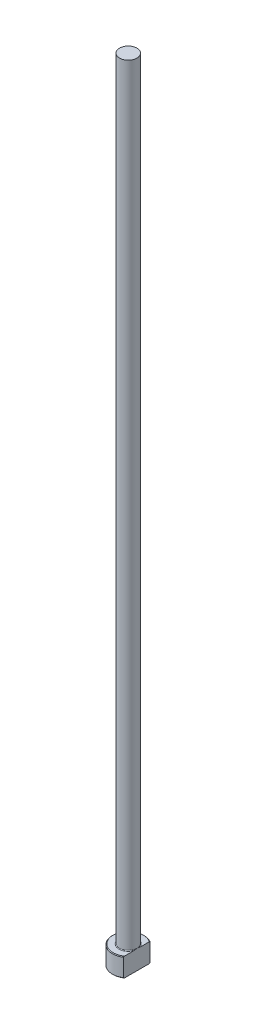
ISO-10303-21;
HEADER;
FILE_DESCRIPTION(('STEP AP214'),'2;1');
FILE_NAME('part.step','',(''),(''),'','','');
FILE_SCHEMA(('AUTOMOTIVE_DESIGN { 1 0 10303 214 1 1 1 1 }'));
ENDSEC;
DATA;
#1=APPLICATION_CONTEXT('core data for automotive mechanical design processes');
#2=APPLICATION_PROTOCOL_DEFINITION('international standard','automotive_design',2000,#1);
#3=PRODUCT_CONTEXT('',#1,'mechanical');
#4=PRODUCT('Part','Part','',(#3));
#5=PRODUCT_RELATED_PRODUCT_CATEGORY('part','',(#4));
#6=PRODUCT_DEFINITION_FORMATION('','',#4);
#7=PRODUCT_DEFINITION_CONTEXT('part definition',#1,'design');
#8=PRODUCT_DEFINITION('design','',#6,#7);
#9=PRODUCT_DEFINITION_SHAPE('','',#8);
#10=(LENGTH_UNIT() NAMED_UNIT(*) SI_UNIT(.MILLI.,.METRE.));
#11=(NAMED_UNIT(*) PLANE_ANGLE_UNIT() SI_UNIT($,.RADIAN.));
#12=(NAMED_UNIT(*) SI_UNIT($,.STERADIAN.) SOLID_ANGLE_UNIT());
#13=UNCERTAINTY_MEASURE_WITH_UNIT(LENGTH_MEASURE(1.E-05),#10,'distance_accuracy_value','');
#14=(GEOMETRIC_REPRESENTATION_CONTEXT(3) GLOBAL_UNCERTAINTY_ASSIGNED_CONTEXT((#13)) GLOBAL_UNIT_ASSIGNED_CONTEXT((#10,
#11,#12)) REPRESENTATION_CONTEXT('',''));
#15=CARTESIAN_POINT('',(0.,0.,0.));
#16=DIRECTION('',(0.,0.,1.));
#17=DIRECTION('',(1.,0.,0.));
#18=AXIS2_PLACEMENT_3D('',#15,#16,#17);
#19=CARTESIAN_POINT('',(0.,0.,0.));
#20=DIRECTION('',(0.,-1.,0.));
#21=DIRECTION('',(0.,0.,-1.));
#22=AXIS2_PLACEMENT_3D('',#19,#20,#21);
#23=PLANE('',#22);
#24=CARTESIAN_POINT('',(0.,0.,0.));
#25=DIRECTION('',(0.,-1.,0.));
#26=DIRECTION('',(0.,0.,-1.));
#27=AXIS2_PLACEMENT_3D('',#24,#25,#26);
#28=CIRCLE('',#27,4.79999999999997);
#29=CARTESIAN_POINT('',(2.74999999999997,0.,3.93414539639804));
#30=VERTEX_POINT('',#29);
#31=CARTESIAN_POINT('',(2.74999999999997,0.,-3.93414539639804));
#32=VERTEX_POINT('',#31);
#33=EDGE_CURVE('E98',#30,#32,#28,.T.);
#34=ORIENTED_EDGE('',*,*,#33,.T.);
#35=DIRECTION('',(0.,0.,1.));
#36=VECTOR('',#35,1.);
#37=CARTESIAN_POINT('',(2.74999999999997,0.,4.1758232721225));
#38=LINE('',#37,#36);
#39=EDGE_CURVE('E83',#32,#30,#38,.T.);
#40=ORIENTED_EDGE('',*,*,#39,.T.);
#41=EDGE_LOOP('',(#34,#40));
#42=FACE_BOUND('',#41,.T.);
#43=ADVANCED_FACE('F32',(#42),#23,.T.);
#44=CARTESIAN_POINT('',(0.,259.958771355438,0.));
#45=DIRECTION('',(0.,1.,0.));
#46=DIRECTION('',(0.,0.,1.));
#47=AXIS2_PLACEMENT_3D('',#44,#45,#46);
#48=CYLINDRICAL_SURFACE('',#47,4.99999999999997);
#49=CARTESIAN_POINT('',(0.,5.80000000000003,0.));
#50=DIRECTION('',(0.,1.,0.));
#51=DIRECTION('',(0.,0.,1.));
#52=AXIS2_PLACEMENT_3D('',#49,#50,#51);
#53=CIRCLE('',#52,4.99999999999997);
#54=CARTESIAN_POINT('',(2.74999999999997,5.80000000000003,4.1758232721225));
#55=VERTEX_POINT('',#54);
#56=CARTESIAN_POINT('',(2.74999999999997,5.80000000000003,-4.1758232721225));
#57=VERTEX_POINT('',#56);
#58=EDGE_CURVE('E104',#55,#57,#53,.F.);
#59=ORIENTED_EDGE('',*,*,#58,.T.);
#60=DIRECTION('',(0.,-1.,0.));
#61=VECTOR('',#60,1.);
#62=CARTESIAN_POINT('',(2.74999999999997,250.,-4.1758232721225));
#63=LINE('',#62,#61);
#64=CARTESIAN_POINT('',(2.74999999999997,0.200000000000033,-4.1758232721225));
#65=VERTEX_POINT('',#64);
#66=EDGE_CURVE('E183',#57,#65,#63,.T.);
#67=ORIENTED_EDGE('',*,*,#66,.T.);
#68=CARTESIAN_POINT('',(0.,0.200000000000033,0.));
#69=DIRECTION('',(0.,-1.,0.));
#70=DIRECTION('',(0.,0.,-1.));
#71=AXIS2_PLACEMENT_3D('',#68,#69,#70);
#72=CIRCLE('',#71,4.99999999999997);
#73=CARTESIAN_POINT('',(2.74999999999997,0.200000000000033,4.1758232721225));
#74=VERTEX_POINT('',#73);
#75=EDGE_CURVE('E100',#65,#74,#72,.F.);
#76=ORIENTED_EDGE('',*,*,#75,.T.);
#77=DIRECTION('',(0.,-1.,0.));
#78=VECTOR('',#77,1.);
#79=CARTESIAN_POINT('',(2.74999999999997,250.,4.1758232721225));
#80=LINE('',#79,#78);
#81=EDGE_CURVE('E93',#55,#74,#80,.T.);
#82=ORIENTED_EDGE('',*,*,#81,.F.);
#83=EDGE_LOOP('',(#59,#67,#76,#82));
#84=FACE_BOUND('',#83,.T.);
#85=ADVANCED_FACE('F158',(#84),#48,.T.);
#86=CARTESIAN_POINT('',(-4.99999999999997,6.,0.));
#87=DIRECTION('',(0.,1.,0.));
#88=DIRECTION('',(0.,0.,1.));
#89=AXIS2_PLACEMENT_3D('',#86,#87,#88);
#90=PLANE('',#89);
#91=CARTESIAN_POINT('',(0.,6.,0.));
#92=DIRECTION('',(0.,1.,0.));
#93=DIRECTION('',(0.,0.,1.));
#94=AXIS2_PLACEMENT_3D('',#91,#92,#93);
#95=CIRCLE('',#94,4.80000000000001);
#96=CARTESIAN_POINT('',(2.74999999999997,6.,-3.93414539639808));
#97=VERTEX_POINT('',#96);
#98=CARTESIAN_POINT('',(2.74999999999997,6.,3.93414539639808));
#99=VERTEX_POINT('',#98);
#100=EDGE_CURVE('E178',#97,#99,#95,.T.);
#101=ORIENTED_EDGE('',*,*,#100,.T.);
#102=DIRECTION('',(0.,0.,-1.));
#103=VECTOR('',#102,1.);
#104=CARTESIAN_POINT('',(2.74999999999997,6.,0.));
#105=LINE('',#104,#103);
#106=CARTESIAN_POINT('',(2.74999999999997,5.99999999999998,1.06770782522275));
#107=VERTEX_POINT('',#106);
#108=EDGE_CURVE('E57',#99,#107,#105,.T.);
#109=ORIENTED_EDGE('',*,*,#108,.T.);
#110=CARTESIAN_POINT('',(0.,6.,0.));
#111=DIRECTION('',(0.,1.,0.));
#112=DIRECTION('',(0.,0.,1.));
#113=AXIS2_PLACEMENT_3D('',#110,#111,#112);
#114=CIRCLE('',#113,2.94999999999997);
#115=CARTESIAN_POINT('',(2.74999999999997,5.99999999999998,-1.06770782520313));
#116=VERTEX_POINT('',#115);
#117=EDGE_CURVE('E107',#107,#116,#114,.F.);
#118=ORIENTED_EDGE('',*,*,#117,.T.);
#119=EDGE_CURVE('E136',#116,#97,#105,.T.);
#120=ORIENTED_EDGE('',*,*,#119,.T.);
#121=EDGE_LOOP('',(#101,#109,#118,#120));
#122=FACE_BOUND('',#121,.T.);
#123=ADVANCED_FACE('F147',(#122),#90,.T.);
#124=CARTESIAN_POINT('',(0.,6.00000000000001,0.));
#125=DIRECTION('',(0.,-1.,0.));
#126=DIRECTION('',(0.,0.,-1.));
#127=AXIS2_PLACEMENT_3D('',#124,#125,#126);
#128=CONICAL_SURFACE('',#127,4.8,0.785398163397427);
#129=ORIENTED_EDGE('',*,*,#58,.F.);
#130=CARTESIAN_POINT('',(2.74999999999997,1.20885441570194,9.18844783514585));
#131=CARTESIAN_POINT('',(2.74999999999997,1.37523675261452,9.01476898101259));
#132=CARTESIAN_POINT('',(2.74999999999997,1.54142180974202,8.84090089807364));
#133=CARTESIAN_POINT('',(2.74999999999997,1.87331224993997,8.49270511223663));
#134=CARTESIAN_POINT('',(2.74999999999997,2.03901762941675,8.31837740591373));
#135=CARTESIAN_POINT('',(2.74999999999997,2.53536746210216,7.79449769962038));
#136=CARTESIAN_POINT('',(2.74999999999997,2.86516041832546,7.44413786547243));
#137=CARTESIAN_POINT('',(2.74999999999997,3.52140645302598,6.74030951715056));
#138=CARTESIAN_POINT('',(2.74999999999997,3.84785962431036,6.38684108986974));
#139=CARTESIAN_POINT('',(2.74999999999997,4.33353933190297,5.85303151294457));
#140=CARTESIAN_POINT('',(2.74999999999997,4.49475728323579,5.67450358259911));
#141=CARTESIAN_POINT('',(2.74999999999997,4.81545552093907,5.3158953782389));
#142=CARTESIAN_POINT('',(2.74999999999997,4.97493583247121,5.13581512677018));
#143=CARTESIAN_POINT('',(2.74999999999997,5.28246157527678,4.78409714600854));
#144=CARTESIAN_POINT('',(2.74999999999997,5.43063567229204,4.61257212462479));
#145=CARTESIAN_POINT('',(2.74999999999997,5.72427023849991,4.2671795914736));
#146=CARTESIAN_POINT('',(2.74999999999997,5.8697304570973,4.09331186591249));
#147=CARTESIAN_POINT('',(2.74999999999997,6.1571622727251,3.74214491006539));
#148=CARTESIAN_POINT('',(2.74999999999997,6.29912659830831,3.56483970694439));
#149=CARTESIAN_POINT('',(2.74999999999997,6.57763983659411,3.20603939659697));
#150=CARTESIAN_POINT('',(2.74999999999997,6.71418980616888,3.02454511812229));
#151=CARTESIAN_POINT('',(2.74999999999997,6.93857405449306,2.71219163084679));
#152=CARTESIAN_POINT('',(2.74999999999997,7.02851673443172,2.58285434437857));
#153=CARTESIAN_POINT('',(2.74999999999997,7.20308451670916,2.32054245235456));
#154=CARTESIAN_POINT('',(2.74999999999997,7.28770764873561,2.18756652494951));
#155=CARTESIAN_POINT('',(2.74999999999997,7.44931959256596,1.91735675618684));
#156=CARTESIAN_POINT('',(2.74999999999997,7.5263237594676,1.78013224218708));
#157=CARTESIAN_POINT('',(2.74999999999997,7.66966790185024,1.50031327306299));
#158=CARTESIAN_POINT('',(2.74999999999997,7.73601725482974,1.35772367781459));
#159=CARTESIAN_POINT('',(2.74999999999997,7.86065113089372,1.04856386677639));
#160=CARTESIAN_POINT('',(2.74999999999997,7.91700799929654,0.881171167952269));
#161=CARTESIAN_POINT('',(2.74999999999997,7.98102802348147,0.625229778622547));
#162=CARTESIAN_POINT('',(2.74999999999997,7.99893817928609,0.539229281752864));
#163=CARTESIAN_POINT('',(2.74999999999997,8.02707157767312,0.365959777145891));
#164=CARTESIAN_POINT('',(2.74999999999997,8.03729562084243,0.278690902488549));
#165=CARTESIAN_POINT('',(2.74999999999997,8.04949232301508,0.10276389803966));
#166=CARTESIAN_POINT('',(2.74999999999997,8.05138838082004,0.0141003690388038));
#167=CARTESIAN_POINT('',(2.74999999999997,8.04659669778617,-0.162990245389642));
#168=CARTESIAN_POINT('',(2.74999999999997,8.03990892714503,-0.25141732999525));
#169=CARTESIAN_POINT('',(2.74999999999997,8.01835539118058,-0.427430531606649));
#170=CARTESIAN_POINT('',(2.74999999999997,8.00347341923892,-0.515014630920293));
#171=CARTESIAN_POINT('',(2.74999999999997,7.96636720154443,-0.688602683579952));
#172=CARTESIAN_POINT('',(2.74999999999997,7.94414138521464,-0.774606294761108));
#173=CARTESIAN_POINT('',(2.74999999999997,7.88037969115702,-0.988315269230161));
#174=CARTESIAN_POINT('',(2.74999999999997,7.83478497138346,-1.11480587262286));
#175=CARTESIAN_POINT('',(2.74999999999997,7.7327190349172,-1.36329985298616));
#176=CARTESIAN_POINT('',(2.74999999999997,7.67623944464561,-1.48529968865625));
#177=CARTESIAN_POINT('',(2.74999999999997,7.55498227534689,-1.72582737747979));
#178=CARTESIAN_POINT('',(2.74999999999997,7.49016436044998,-1.84433466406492));
#179=CARTESIAN_POINT('',(2.74999999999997,7.38849038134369,-2.01944141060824));
#180=CARTESIAN_POINT('',(2.74999999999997,7.35386385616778,-2.07735876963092));
#181=CARTESIAN_POINT('',(2.74999999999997,7.28331846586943,-2.19239883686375));
#182=CARTESIAN_POINT('',(2.74999999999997,7.24739965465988,-2.24952157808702));
#183=CARTESIAN_POINT('',(2.74999999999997,7.12488368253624,-2.44019263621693));
#184=CARTESIAN_POINT('',(2.74999999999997,7.03574833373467,-2.57211125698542));
#185=CARTESIAN_POINT('',(2.74999999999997,6.85300432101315,-2.83282496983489));
#186=CARTESIAN_POINT('',(2.74999999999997,6.7593946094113,-2.96161931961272));
#187=CARTESIAN_POINT('',(2.74999999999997,6.56878484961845,-3.21681212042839));
#188=CARTESIAN_POINT('',(2.74999999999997,6.47178237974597,-3.34320875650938));
#189=CARTESIAN_POINT('',(2.74999999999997,6.27524323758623,-3.59402090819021));
#190=CARTESIAN_POINT('',(2.74999999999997,6.17570641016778,-3.71843630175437));
#191=CARTESIAN_POINT('',(2.74999999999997,5.97442282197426,-3.9659672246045));
#192=CARTESIAN_POINT('',(2.74999999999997,5.87267126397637,-4.08907884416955));
#193=CARTESIAN_POINT('',(2.74999999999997,5.66760125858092,-4.33399167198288));
#194=CARTESIAN_POINT('',(2.74999999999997,5.56428277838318,-4.45579285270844));
#195=CARTESIAN_POINT('',(2.74999999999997,5.25255029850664,-4.81947940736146));
#196=CARTESIAN_POINT('',(2.74999999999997,5.04226620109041,-5.05976099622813));
#197=CARTESIAN_POINT('',(2.74999999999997,4.61812846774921,-5.53760543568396));
#198=CARTESIAN_POINT('',(2.74999999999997,4.40427119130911,-5.77516503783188));
#199=CARTESIAN_POINT('',(2.74999999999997,3.97415714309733,-6.24814387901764));
#200=CARTESIAN_POINT('',(2.74999999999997,3.75790012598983,-6.48356289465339));
#201=CARTESIAN_POINT('',(2.74999999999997,3.32391192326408,-6.952499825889));
#202=CARTESIAN_POINT('',(2.74999999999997,3.10618287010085,-7.18601971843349));
#203=CARTESIAN_POINT('',(2.74999999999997,2.66941287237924,-7.65182952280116));
#204=CARTESIAN_POINT('',(2.74999999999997,2.45037192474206,-7.88411943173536));
#205=CARTESIAN_POINT('',(2.74999999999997,2.14586495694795,-8.20563072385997));
#206=CARTESIAN_POINT('',(2.74999999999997,2.06083046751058,-8.29526139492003));
#207=CARTESIAN_POINT('',(2.74999999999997,1.8906088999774,-8.47440444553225));
#208=CARTESIAN_POINT('',(2.74999999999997,1.8054218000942,-8.56391680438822));
#209=CARTESIAN_POINT('',(2.74999999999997,1.63506457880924,-8.74266965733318));
#210=CARTESIAN_POINT('',(2.74999999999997,1.54989467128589,-8.83191035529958));
#211=CARTESIAN_POINT('',(2.74999999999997,1.37945223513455,-9.01026683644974));
#212=CARTESIAN_POINT('',(2.74999999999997,1.29417972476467,-9.0993826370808));
#213=CARTESIAN_POINT('',(2.74999999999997,1.20885441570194,-9.18844783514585));
#214=B_SPLINE_CURVE_WITH_KNOTS('',3,(#130,#131,#132,#133,#134,#135,#136,#137,#138,#139,#140,
#141,#142,#143,#144,#145,#146,#147,#148,#149,#150,#151,#152,#153,#154,#155,#156,#157,#158,#159,
#160,#161,#162,#163,#164,#165,#166,#167,#168,#169,#170,#171,#172,#173,#174,#175,#176,#177,#178,
#179,#180,#181,#182,#183,#184,#185,#186,#187,#188,#189,#190,#191,#192,#193,#194,#195,#196,#197,
#198,#199,#200,#201,#202,#203,#204,#205,#206,#207,#208,#209,#210,#211,#212,#213),.UNSPECIFIED.,
.F.,.F.,(4,2,2,2,2,2,2,2,2,2,2,2,2,2,2,2,2,2,2,2,2,2,2,2,2,2,2,2,2,2,2,2,2,2,2,2,2,2,2,2,2,4),
(0.,0.721544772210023,1.44309493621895,2.88656432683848,4.3299934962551,5.05163004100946,
5.77325612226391,6.45322671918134,7.13325979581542,7.81460476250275,8.49581607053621,
8.96833065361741,9.44101923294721,9.91273488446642,10.3840330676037,10.9119743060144,
11.1752192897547,11.438436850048,11.7040704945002,11.9697050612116,12.2358669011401,
12.5020857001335,12.9047274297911,13.3076801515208,13.7126610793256,13.915085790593,
14.1175020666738,14.5949844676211,15.072579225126,15.5505221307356,16.0284943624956,
16.5076321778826,16.986780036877,17.9446362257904,18.9035363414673,19.8625354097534,
20.8203587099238,21.7781842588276,22.1488332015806,22.5195401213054,22.8896215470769,
23.2596447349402),.UNSPECIFIED.);
#215=EDGE_CURVE('E135',#55,#99,#214,.T.);
#216=ORIENTED_EDGE('',*,*,#215,.T.);
#217=ORIENTED_EDGE('',*,*,#100,.F.);
#218=EDGE_CURVE('E127',#97,#57,#214,.T.);
#219=ORIENTED_EDGE('',*,*,#218,.T.);
#220=EDGE_LOOP('',(#129,#216,#217,#219));
#221=FACE_BOUND('',#220,.T.);
#222=ADVANCED_FACE('F143',(#221),#128,.T.);
#223=CARTESIAN_POINT('',(0.,0.200000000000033,0.));
#224=DIRECTION('',(0.,1.,0.));
#225=DIRECTION('',(0.,0.,1.));
#226=AXIS2_PLACEMENT_3D('',#223,#224,#225);
#227=CONICAL_SURFACE('',#226,4.99999999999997,0.785398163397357);
#228=ORIENTED_EDGE('',*,*,#75,.F.);
#229=CARTESIAN_POINT('',(2.74999999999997,4.79114558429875,-9.18844783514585));
#230=CARTESIAN_POINT('',(2.74999999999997,4.62476324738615,-9.01476898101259));
#231=CARTESIAN_POINT('',(2.74999999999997,4.45857819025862,-8.84090089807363));
#232=CARTESIAN_POINT('',(2.74999999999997,4.12668775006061,-8.49270511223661));
#233=CARTESIAN_POINT('',(2.74999999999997,3.96098237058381,-8.3183774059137));
#234=CARTESIAN_POINT('',(2.74999999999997,3.46463253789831,-7.79449769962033));
#235=CARTESIAN_POINT('',(2.74999999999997,3.13483958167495,-7.44413786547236));
#236=CARTESIAN_POINT('',(2.74999999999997,2.47859354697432,-6.74030951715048));
#237=CARTESIAN_POINT('',(2.74999999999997,2.15214037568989,-6.38684108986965));
#238=CARTESIAN_POINT('',(2.74999999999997,1.66646066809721,-5.85303151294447));
#239=CARTESIAN_POINT('',(2.74999999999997,1.50524271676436,-5.674503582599));
#240=CARTESIAN_POINT('',(2.74999999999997,1.18454447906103,-5.31589537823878));
#241=CARTESIAN_POINT('',(2.74999999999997,1.02506416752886,-5.13581512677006));
#242=CARTESIAN_POINT('',(2.74999999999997,0.717538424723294,-4.78409714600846));
#243=CARTESIAN_POINT('',(2.74999999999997,0.569364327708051,-4.61257212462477));
#244=CARTESIAN_POINT('',(2.74999999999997,0.275729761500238,-4.26717959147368));
#245=CARTESIAN_POINT('',(2.74999999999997,0.130269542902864,-4.09331186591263));
#246=CARTESIAN_POINT('',(2.74999999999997,-0.157162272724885,-3.74214491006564));
#247=CARTESIAN_POINT('',(2.74999999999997,-0.299126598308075,-3.56483970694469));
#248=CARTESIAN_POINT('',(2.74999999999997,-0.577639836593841,-3.20603939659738));
#249=CARTESIAN_POINT('',(2.74999999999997,-0.714189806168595,-3.02454511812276));
#250=CARTESIAN_POINT('',(2.74999999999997,-0.938574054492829,-2.71219163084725));
#251=CARTESIAN_POINT('',(2.74999999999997,-1.02851673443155,-2.58285434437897));
#252=CARTESIAN_POINT('',(2.74999999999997,-1.20308451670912,-2.32054245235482));
#253=CARTESIAN_POINT('',(2.74999999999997,-1.28770764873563,-2.18756652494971));
#254=CARTESIAN_POINT('',(2.74999999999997,-1.4493195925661,-1.91735675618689));
#255=CARTESIAN_POINT('',(2.74999999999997,-1.52632375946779,-1.78013224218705));
#256=CARTESIAN_POINT('',(2.74999999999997,-1.66966790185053,-1.50031327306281));
#257=CARTESIAN_POINT('',(2.74999999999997,-1.73601725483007,-1.35772367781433));
#258=CARTESIAN_POINT('',(2.74999999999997,-1.86065113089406,-1.04856386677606));
#259=CARTESIAN_POINT('',(2.74999999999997,-1.91700799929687,-0.881171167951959));
#260=CARTESIAN_POINT('',(2.74999999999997,-1.98102802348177,-0.625229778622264));
#261=CARTESIAN_POINT('',(2.74999999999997,-1.99893817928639,-0.539229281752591));
#262=CARTESIAN_POINT('',(2.74999999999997,-2.0270715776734,-0.365959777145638));
#263=CARTESIAN_POINT('',(2.74999999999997,-2.0372956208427,-0.278690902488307));
#264=CARTESIAN_POINT('',(2.74999999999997,-2.04949232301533,-0.102763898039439));
#265=CARTESIAN_POINT('',(2.74999999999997,-2.0513883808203,-0.0141003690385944));
#266=CARTESIAN_POINT('',(2.74999999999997,-2.04659669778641,0.162990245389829));
#267=CARTESIAN_POINT('',(2.74999999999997,-2.03990892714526,0.251417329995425));
#268=CARTESIAN_POINT('',(2.74999999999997,-2.01835539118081,0.4274305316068));
#269=CARTESIAN_POINT('',(2.74999999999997,-2.00347341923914,0.515014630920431));
#270=CARTESIAN_POINT('',(2.74999999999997,-1.96636720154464,0.688602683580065));
#271=CARTESIAN_POINT('',(2.74999999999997,-1.94414138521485,0.774606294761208));
#272=CARTESIAN_POINT('',(2.74999999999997,-1.88037969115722,0.988315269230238));
#273=CARTESIAN_POINT('',(2.74999999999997,-1.83478497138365,1.11480587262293));
#274=CARTESIAN_POINT('',(2.74999999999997,-1.73271903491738,1.36329985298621));
#275=CARTESIAN_POINT('',(2.74999999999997,-1.67623944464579,1.48529968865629));
#276=CARTESIAN_POINT('',(2.74999999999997,-1.55498227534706,1.7258273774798));
#277=CARTESIAN_POINT('',(2.74999999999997,-1.49016436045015,1.84433466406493));
#278=CARTESIAN_POINT('',(2.74999999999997,-1.38849038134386,2.01944141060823));
#279=CARTESIAN_POINT('',(2.74999999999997,-1.35386385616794,2.07735876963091));
#280=CARTESIAN_POINT('',(2.74999999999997,-1.28331846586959,2.19239883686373));
#281=CARTESIAN_POINT('',(2.74999999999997,-1.24739965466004,2.24952157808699));
#282=CARTESIAN_POINT('',(2.74999999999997,-1.12488368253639,2.44019263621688));
#283=CARTESIAN_POINT('',(2.74999999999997,-1.03574833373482,2.57211125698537));
#284=CARTESIAN_POINT('',(2.74999999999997,-0.853004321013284,2.83282496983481));
#285=CARTESIAN_POINT('',(2.74999999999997,-0.75939460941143,2.96161931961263));
#286=CARTESIAN_POINT('',(2.74999999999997,-0.568784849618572,3.21681212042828));
#287=CARTESIAN_POINT('',(2.74999999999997,-0.471782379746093,3.34320875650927));
#288=CARTESIAN_POINT('',(2.74999999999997,-0.275243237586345,3.59402090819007));
#289=CARTESIAN_POINT('',(2.74999999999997,-0.175706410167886,3.71843630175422));
#290=CARTESIAN_POINT('',(2.74999999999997,0.025577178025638,3.96596722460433));
#291=CARTESIAN_POINT('',(2.74999999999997,0.127328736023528,4.08907884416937));
#292=CARTESIAN_POINT('',(2.74999999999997,0.33239874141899,4.33399167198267));
#293=CARTESIAN_POINT('',(2.74999999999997,0.435717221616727,4.45579285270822));
#294=CARTESIAN_POINT('',(2.74999999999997,0.747449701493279,4.81947940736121));
#295=CARTESIAN_POINT('',(2.74999999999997,0.95773379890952,5.05976099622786));
#296=CARTESIAN_POINT('',(2.74999999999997,1.38187153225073,5.53760543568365));
#297=CARTESIAN_POINT('',(2.74999999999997,1.59572880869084,5.77516503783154));
#298=CARTESIAN_POINT('',(2.74999999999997,2.02584285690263,6.24814387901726));
#299=CARTESIAN_POINT('',(2.74999999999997,2.24209987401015,6.48356289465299));
#300=CARTESIAN_POINT('',(2.74999999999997,2.67608807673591,6.95249982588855));
#301=CARTESIAN_POINT('',(2.74999999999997,2.89381712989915,7.18601971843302));
#302=CARTESIAN_POINT('',(2.74999999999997,3.33058712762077,7.65182952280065));
#303=CARTESIAN_POINT('',(2.74999999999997,3.54962807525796,7.88411943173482));
#304=CARTESIAN_POINT('',(2.74999999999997,3.85413504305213,8.20563072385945));
#305=CARTESIAN_POINT('',(2.74999999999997,3.93916953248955,8.29526139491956));
#306=CARTESIAN_POINT('',(2.74999999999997,4.10939110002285,8.47440444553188));
#307=CARTESIAN_POINT('',(2.74999999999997,4.1945781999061,8.5639168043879));
#308=CARTESIAN_POINT('',(2.74999999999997,4.36493542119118,8.74266965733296));
#309=CARTESIAN_POINT('',(2.74999999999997,4.45010532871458,8.8319103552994));
#310=CARTESIAN_POINT('',(2.74999999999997,4.62054776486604,9.01026683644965));
#311=CARTESIAN_POINT('',(2.74999999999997,4.70582027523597,9.09938263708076));
#312=CARTESIAN_POINT('',(2.74999999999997,4.79114558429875,9.18844783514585));
#313=B_SPLINE_CURVE_WITH_KNOTS('',3,(#229,#230,#231,#232,#233,#234,#235,#236,#237,#238,#239,
#240,#241,#242,#243,#244,#245,#246,#247,#248,#249,#250,#251,#252,#253,#254,#255,#256,#257,#258,
#259,#260,#261,#262,#263,#264,#265,#266,#267,#268,#269,#270,#271,#272,#273,#274,#275,#276,#277,
#278,#279,#280,#281,#282,#283,#284,#285,#286,#287,#288,#289,#290,#291,#292,#293,#294,#295,#296,
#297,#298,#299,#300,#301,#302,#303,#304,#305,#306,#307,#308,#309,#310,#311,#312),.UNSPECIFIED.,
.F.,.F.,(4,2,2,2,2,2,2,2,2,2,2,2,2,2,2,2,2,2,2,2,2,2,2,2,2,2,2,2,2,2,2,2,2,2,2,2,2,2,2,2,2,4),
(0.,0.721544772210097,1.4430949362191,2.88656432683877,4.32999349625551,5.05163004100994,
5.77325612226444,6.45322671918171,7.13325979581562,7.81460476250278,8.49581607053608,
8.96833065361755,9.44101923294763,9.91273488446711,10.3840330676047,10.9119743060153,
11.1752192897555,11.4384368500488,11.704070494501,11.9697050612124,12.2358669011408,
12.5020857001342,12.9047274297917,13.3076801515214,13.7126610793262,13.9150857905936,
14.1175020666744,14.5949844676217,15.0725792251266,15.5505221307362,16.0284943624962,
16.5076321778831,16.9867800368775,17.9446362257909,18.9035363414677,19.8625354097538,
20.8203587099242,21.7781842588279,22.1488332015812,22.5195401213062,22.8896215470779,
23.2596447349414),.UNSPECIFIED.);
#314=EDGE_CURVE('E86',#65,#32,#313,.T.);
#315=ORIENTED_EDGE('',*,*,#314,.T.);
#316=ORIENTED_EDGE('',*,*,#33,.F.);
#317=EDGE_CURVE('E89',#30,#74,#313,.T.);
#318=ORIENTED_EDGE('',*,*,#317,.T.);
#319=EDGE_LOOP('',(#228,#315,#316,#318));
#320=FACE_BOUND('',#319,.T.);
#321=ADVANCED_FACE('F97',(#320),#227,.T.);
#322=CARTESIAN_POINT('',(0.,6.19999999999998,0.));
#323=DIRECTION('',(0.,1.,0.));
#324=DIRECTION('',(0.,0.,1.));
#325=AXIS2_PLACEMENT_3D('',#322,#323,#324);
#326=TOROIDAL_SURFACE('',#325,2.94999999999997,0.2);
#327=CARTESIAN_POINT('',(2.74999999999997,6.19999999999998,0.));
#328=CARTESIAN_POINT('',(2.74999999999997,6.20000050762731,1.12997204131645E-10));
#329=CARTESIAN_POINT('',(2.74999999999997,6.20000101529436,-1.81527538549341E-07));
#330=CARTESIAN_POINT('',(2.74999999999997,6.20000196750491,-6.94840321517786E-07));
#331=CARTESIAN_POINT('',(2.74999999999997,6.20000240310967,-1.03787719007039E-06));
#332=CARTESIAN_POINT('',(2.74999999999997,6.2000033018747,-1.85808129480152E-06));
#333=CARTESIAN_POINT('',(2.74999999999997,6.20000375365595,-2.34835983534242E-06));
#334=CARTESIAN_POINT('',(2.74999999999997,6.20000456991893,-3.37046961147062E-06));
#335=CARTESIAN_POINT('',(2.74999999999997,6.20000493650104,-3.90074161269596E-06));
#336=CARTESIAN_POINT('',(2.74999999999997,6.20000627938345,-5.9326173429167E-06));
#337=CARTESIAN_POINT('',(2.74999999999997,6.20000718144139,-7.48563177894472E-06));
#338=CARTESIAN_POINT('',(2.74999999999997,6.20000868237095,-1.05790083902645E-05));
#339=CARTESIAN_POINT('',(2.74999999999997,6.20000929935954,-1.21109700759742E-05));
#340=CARTESIAN_POINT('',(2.74999999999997,6.20001185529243,-1.85322193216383E-05));
#341=CARTESIAN_POINT('',(2.74999999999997,6.20001373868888,-2.34472712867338E-05));
#342=CARTESIAN_POINT('',(2.74999999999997,6.20001654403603,-3.27779453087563E-05));
#343=CARTESIAN_POINT('',(2.74999999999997,6.20001756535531,-3.71636224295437E-05));
#344=CARTESIAN_POINT('',(2.74999999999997,6.20002495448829,-6.95743734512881E-05));
#345=CARTESIAN_POINT('',(2.74999999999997,6.20003050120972,-9.77394526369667E-05));
#346=CARTESIAN_POINT('',(2.74999999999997,6.2000547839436,-0.000208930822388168));
#347=CARTESIAN_POINT('',(2.74999999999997,6.20007801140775,-0.000290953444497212));
#348=CARTESIAN_POINT('',(2.74999999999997,6.20016837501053,-0.00061567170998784));
#349=CARTESIAN_POINT('',(2.74999999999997,6.20023256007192,-0.000858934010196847));
#350=CARTESIAN_POINT('',(2.74999999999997,6.20048946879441,-0.00182516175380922));
#351=CARTESIAN_POINT('',(2.74999999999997,6.20068588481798,-0.00254739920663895));
#352=CARTESIAN_POINT('',(2.74999999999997,6.20150145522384,-0.00555461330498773));
#353=CARTESIAN_POINT('',(2.74999999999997,6.20211597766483,-0.00784050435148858));
#354=CARTESIAN_POINT('',(2.74999999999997,6.20754641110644,-0.0280301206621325));
#355=CARTESIAN_POINT('',(2.74999999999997,6.21238054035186,-0.0459303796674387));
#356=CARTESIAN_POINT('',(2.74999999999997,6.22182435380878,-0.0810299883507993));
#357=CARTESIAN_POINT('',(2.74999999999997,6.22643534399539,-0.0982290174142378));
#358=CARTESIAN_POINT('',(2.74999999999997,6.23620184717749,-0.134808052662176));
#359=CARTESIAN_POINT('',(2.74999999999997,6.24135263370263,-0.154189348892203));
#360=CARTESIAN_POINT('',(2.74999999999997,6.25163624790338,-0.193181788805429));
#361=CARTESIAN_POINT('',(2.74999999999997,6.25676827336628,-0.212793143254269));
#362=CARTESIAN_POINT('',(2.74999999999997,6.26905119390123,-0.260223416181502));
#363=CARTESIAN_POINT('',(2.74999999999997,6.27615177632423,-0.288055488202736));
#364=CARTESIAN_POINT('',(2.74999999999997,6.28988618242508,-0.343037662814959));
#365=CARTESIAN_POINT('',(2.74999999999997,6.29652742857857,-0.37018592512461));
#366=CARTESIAN_POINT('',(2.74999999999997,6.31791197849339,-0.460013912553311));
#367=CARTESIAN_POINT('',(2.74999999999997,6.33192996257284,-0.522872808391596));
#368=CARTESIAN_POINT('',(2.74999999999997,6.35724782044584,-0.649858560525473));
#369=CARTESIAN_POINT('',(2.74999999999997,6.36851625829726,-0.71399176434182));
#370=CARTESIAN_POINT('',(2.74999999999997,6.38744836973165,-0.848144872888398));
#371=CARTESIAN_POINT('',(2.74999999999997,6.39474814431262,-0.918222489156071));
#372=CARTESIAN_POINT('',(2.74999999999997,6.39971832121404,-1.02344881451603));
#373=CARTESIAN_POINT('',(2.74999999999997,6.40038441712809,-1.05845158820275));
#374=CARTESIAN_POINT('',(2.74999999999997,6.39917295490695,-1.1284044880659));
#375=CARTESIAN_POINT('',(2.74999999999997,6.39729798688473,-1.16335463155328));
#376=CARTESIAN_POINT('',(2.74999999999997,6.39199994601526,-1.21505383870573));
#377=CARTESIAN_POINT('',(2.74999999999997,6.38986571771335,-1.23193598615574));
#378=CARTESIAN_POINT('',(2.74999999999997,6.38464996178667,-1.2655715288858));
#379=CARTESIAN_POINT('',(2.74999999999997,6.38156766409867,-1.28232480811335));
#380=CARTESIAN_POINT('',(2.74999999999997,6.37431364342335,-1.31540767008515));
#381=CARTESIAN_POINT('',(2.74999999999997,6.37015411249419,-1.33173987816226));
#382=CARTESIAN_POINT('',(2.74999999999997,6.36048976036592,-1.36399299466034));
#383=CARTESIAN_POINT('',(2.74999999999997,6.35498646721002,-1.37991434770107));
#384=CARTESIAN_POINT('',(2.74999999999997,6.34222746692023,-1.41123903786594));
#385=CARTESIAN_POINT('',(2.74999999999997,6.33495457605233,-1.42663549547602));
#386=CARTESIAN_POINT('',(2.74999999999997,6.318175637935,-1.45617471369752));
#387=CARTESIAN_POINT('',(2.74999999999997,6.30867792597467,-1.4703218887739));
#388=CARTESIAN_POINT('',(2.74999999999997,6.29277007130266,-1.48907990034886));
#389=CARTESIAN_POINT('',(2.74999999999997,6.2875192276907,-1.49466894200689));
#390=CARTESIAN_POINT('',(2.74999999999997,6.27634440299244,-1.50515028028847));
#391=CARTESIAN_POINT('',(2.74999999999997,6.27042002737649,-1.51004216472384));
#392=CARTESIAN_POINT('',(2.74999999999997,6.25778482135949,-1.51891099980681));
#393=CARTESIAN_POINT('',(2.74999999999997,6.2510643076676,-1.52287446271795));
#394=CARTESIAN_POINT('',(2.74999999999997,6.23698143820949,-1.52941740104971));
#395=CARTESIAN_POINT('',(2.74999999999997,6.22962116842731,-1.53200119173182));
#396=CARTESIAN_POINT('',(2.74999999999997,6.2166326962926,-1.53496289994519));
#397=CARTESIAN_POINT('',(2.74999999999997,6.2110985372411,-1.53575651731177));
#398=CARTESIAN_POINT('',(2.74999999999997,6.19997558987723,-1.53638738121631));
#399=CARTESIAN_POINT('',(2.74999999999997,6.19438682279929,-1.53622498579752));
#400=CARTESIAN_POINT('',(2.74999999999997,6.18332943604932,-1.53495937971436));
#401=CARTESIAN_POINT('',(2.74999999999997,6.17786061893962,-1.53385785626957));
#402=CARTESIAN_POINT('',(2.74999999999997,6.16716525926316,-1.53080991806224));
#403=CARTESIAN_POINT('',(2.74999999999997,6.16193889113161,-1.52886290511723));
#404=CARTESIAN_POINT('',(2.74999999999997,6.14983366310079,-1.52335528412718));
#405=CARTESIAN_POINT('',(2.74999999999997,6.14310699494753,-1.51946144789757));
#406=CARTESIAN_POINT('',(2.74999999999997,6.13035821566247,-1.51065443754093));
#407=CARTESIAN_POINT('',(2.74999999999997,6.12433789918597,-1.5057387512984));
#408=CARTESIAN_POINT('',(2.74999999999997,6.10956608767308,-1.4920109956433));
#409=CARTESIAN_POINT('',(2.74999999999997,6.10134587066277,-1.48263193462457));
#410=CARTESIAN_POINT('',(2.74999999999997,6.08638427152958,-1.46278796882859));
#411=CARTESIAN_POINT('',(2.74999999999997,6.07964511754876,-1.45232146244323));
#412=CARTESIAN_POINT('',(2.74999999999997,6.06171675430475,-1.42080727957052));
#413=CARTESIAN_POINT('',(2.74999999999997,6.05211924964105,-1.39886385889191));
#414=CARTESIAN_POINT('',(2.74999999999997,6.03592584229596,-1.35377597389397));
#415=CARTESIAN_POINT('',(2.74999999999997,6.02935693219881,-1.33062268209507));
#416=CARTESIAN_POINT('',(2.74999999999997,6.01641276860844,-1.27469229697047));
#417=CARTESIAN_POINT('',(2.74999999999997,6.01110503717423,-1.24167224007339));
#418=CARTESIAN_POINT('',(2.74999999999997,6.00364182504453,-1.17522319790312));
#419=CARTESIAN_POINT('',(2.74999999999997,6.00149608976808,-1.1417932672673));
#420=CARTESIAN_POINT('',(2.74999999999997,5.99965905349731,-1.07618467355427));
#421=CARTESIAN_POINT('',(2.74999999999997,5.9998750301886,-1.04400821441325));
#422=CARTESIAN_POINT('',(2.74999999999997,6.00208041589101,-0.979705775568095));
#423=CARTESIAN_POINT('',(2.74999999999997,6.0040708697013,-0.947579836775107));
#424=CARTESIAN_POINT('',(2.74999999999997,6.01231998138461,-0.849711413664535));
#425=CARTESIAN_POINT('',(2.74999999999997,6.02086596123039,-0.784164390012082));
#426=CARTESIAN_POINT('',(2.74999999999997,6.04217753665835,-0.652153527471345));
#427=CARTESIAN_POINT('',(2.74999999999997,6.05504187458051,-0.585706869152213));
#428=CARTESIAN_POINT('',(2.74999999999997,6.07899589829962,-0.474257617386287));
#429=CARTESIAN_POINT('',(2.74999999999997,6.0893670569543,-0.429096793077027));
#430=CARTESIAN_POINT('',(2.74999999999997,6.11088695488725,-0.339494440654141));
#431=CARTESIAN_POINT('',(2.74999999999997,6.12202574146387,-0.295050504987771));
#432=CARTESIAN_POINT('',(2.74999999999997,6.1435522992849,-0.211341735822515));
#433=CARTESIAN_POINT('',(2.74999999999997,6.15388178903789,-0.172061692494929));
#434=CARTESIAN_POINT('',(2.74999999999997,6.17523671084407,-0.0918970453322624));
#435=CARTESIAN_POINT('',(2.74999999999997,6.18627305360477,-0.0510152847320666));
#436=CARTESIAN_POINT('',(2.74999999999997,6.19788514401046,-0.00783595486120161));
#437=CARTESIAN_POINT('',(2.74999999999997,6.19850096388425,-0.00554554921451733));
#438=CARTESIAN_POINT('',(2.74999999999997,6.19931683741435,-0.00253730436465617));
#439=CARTESIAN_POINT('',(2.74999999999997,6.19951229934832,-0.00181855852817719));
#440=CARTESIAN_POINT('',(2.74999999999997,6.19976804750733,-0.000856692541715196));
#441=CARTESIAN_POINT('',(2.74999999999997,6.19983200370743,-0.00061429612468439));
#442=CARTESIAN_POINT('',(2.74999999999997,6.19992209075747,-0.000290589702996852));
#443=CARTESIAN_POINT('',(2.74999999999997,6.19994527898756,-0.000208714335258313));
#444=CARTESIAN_POINT('',(2.74999999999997,6.1999695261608,-9.76928431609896E-05));
#445=CARTESIAN_POINT('',(2.74999999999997,6.19997506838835,-6.95486159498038E-05));
#446=CARTESIAN_POINT('',(2.74999999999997,6.19998244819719,-3.71590916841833E-05));
#447=CARTESIAN_POINT('',(2.74999999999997,6.19998346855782,-3.27745922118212E-05));
#448=CARTESIAN_POINT('',(2.74999999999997,6.19998627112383,-2.34463159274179E-05));
#449=CARTESIAN_POINT('',(2.74999999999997,6.19998815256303,-1.85324215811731E-05));
#450=CARTESIAN_POINT('',(2.74999999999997,6.19999070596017,-1.21123670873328E-05));
#451=CARTESIAN_POINT('',(2.74999999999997,6.19999132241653,-1.05804935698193E-05));
#452=CARTESIAN_POINT('',(2.74999999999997,6.19999282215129,-7.48720406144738E-06));
#453=CARTESIAN_POINT('',(2.74999999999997,6.19999372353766,-5.93417788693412E-06));
#454=CARTESIAN_POINT('',(2.74999999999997,6.1999950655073,-3.90218207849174E-06));
#455=CARTESIAN_POINT('',(2.74999999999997,6.19999543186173,-3.37185002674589E-06));
#456=CARTESIAN_POINT('',(2.74999999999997,6.19999624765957,-2.34957905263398E-06));
#457=CARTESIAN_POINT('',(2.74999999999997,6.19999669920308,-1.8591980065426E-06));
#458=CARTESIAN_POINT('',(2.74999999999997,6.19999759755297,-1.03875219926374E-06));
#459=CARTESIAN_POINT('',(2.74999999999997,6.19999803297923,-6.95584904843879E-07));
#460=CARTESIAN_POINT('',(2.74999999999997,6.19999898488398,-1.81944082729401E-07));
#461=CARTESIAN_POINT('',(2.74999999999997,6.19999949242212,-1.12986192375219E-10));
#462=CARTESIAN_POINT('',(2.74999999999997,6.19999999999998,0.));
#463=B_SPLINE_CURVE_WITH_KNOTS('',3,(#327,#328,#329,#330,#331,#332,#333,#334,#335,#336,#337,
#338,#339,#340,#341,#342,#343,#344,#345,#346,#347,#348,#349,#350,#351,#352,#353,#354,#355,#356,
#357,#358,#359,#360,#361,#362,#363,#364,#365,#366,#367,#368,#369,#370,#371,#372,#373,#374,#375,
#376,#377,#378,#379,#380,#381,#382,#383,#384,#385,#386,#387,#388,#389,#390,#391,#392,#393,#394,
#395,#396,#397,#398,#399,#400,#401,#402,#403,#404,#405,#406,#407,#408,#409,#410,#411,#412,#413,
#414,#415,#416,#417,#418,#419,#420,#421,#422,#423,#424,#425,#426,#427,#428,#429,#430,#431,#432,
#433,#434,#435,#436,#437,#438,#439,#440,#441,#442,#443,#444,#445,#446,#447,#448,#449,#450,#451,
#452,#453,#454,#455,#456,#457,#458,#459,#460,#461,#462),.UNSPECIFIED.,.T.,.F.,(4,2,2,2,2,2,2,2,
2,2,2,2,2,2,2,2,2,2,2,2,2,2,2,2,2,2,2,2,2,2,2,2,2,2,2,2,2,2,2,2,2,2,2,2,2,2,2,2,2,2,2,2,2,2,2,2,
2,2,2,2,2,2,2,2,2,2,2,4),(0.,1.53302756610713E-06,3.19538918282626E-06,5.18410383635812E-06,
7.11680689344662E-06,1.24843263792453E-05,1.74346119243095E-05,3.31954282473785E-05,
4.66876451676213E-05,0.000132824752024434,0.000388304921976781,0.00114333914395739,
0.00338841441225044,0.0104899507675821,0.0661127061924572,0.119532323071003,0.179694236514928,
0.240509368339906,0.3266784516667,0.41052476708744,0.603684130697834,0.798958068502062,
1.00997653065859,1.1149423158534,1.2198011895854,1.27083021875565,1.32190080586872,
1.37241688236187,1.42287578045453,1.47384571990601,1.52462767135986,1.54758745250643,
1.57056075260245,1.59384955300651,1.61706507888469,1.6337610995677,1.65045086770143,
1.66711071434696,1.68378236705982,1.70696786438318,1.73021104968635,1.76741395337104,
1.80467244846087,1.87612299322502,1.94819858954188,2.04828679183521,2.14868283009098,
2.24515187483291,2.34167775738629,2.53976637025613,2.74273377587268,2.88173187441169,
3.0191810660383,3.1410275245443,3.26805859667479,3.27517420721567,3.27740842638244,
3.27816077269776,3.27841579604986,3.27850186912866,3.27851535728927,3.27853111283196,
3.27853606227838,3.27854142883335,3.27854336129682,3.27854534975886,3.27854701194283,
3.278548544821),.UNSPECIFIED.);
#464=CARTESIAN_POINT('',(2.74999999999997,6.19999999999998,0.));
#465=VERTEX_POINT('',#464);
#466=EDGE_CURVE('E11',#116,#465,#463,.T.);
#467=ORIENTED_EDGE('',*,*,#466,.F.);
#468=ORIENTED_EDGE('',*,*,#117,.F.);
#469=CARTESIAN_POINT('',(2.74999999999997,6.19999999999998,0.));
#470=CARTESIAN_POINT('',(2.74999999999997,6.19999949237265,-1.12997140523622E-10));
#471=CARTESIAN_POINT('',(2.74999999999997,6.1999989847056,1.81527538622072E-07));
#472=CARTESIAN_POINT('',(2.74999999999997,6.19999803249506,6.94840321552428E-07));
#473=CARTESIAN_POINT('',(2.74999999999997,6.1999975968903,1.03787719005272E-06));
#474=CARTESIAN_POINT('',(2.74999999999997,6.19999669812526,1.85808129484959E-06));
#475=CARTESIAN_POINT('',(2.74999999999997,6.19999624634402,2.34835983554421E-06));
#476=CARTESIAN_POINT('',(2.74999999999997,6.19999543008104,3.37046961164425E-06));
#477=CARTESIAN_POINT('',(2.74999999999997,6.19999506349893,3.90074161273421E-06));
#478=CARTESIAN_POINT('',(2.74999999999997,6.19999372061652,5.93261734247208E-06));
#479=CARTESIAN_POINT('',(2.74999999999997,6.19999281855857,7.48563177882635E-06));
#480=CARTESIAN_POINT('',(2.74999999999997,6.19999131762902,1.05790083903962E-05));
#481=CARTESIAN_POINT('',(2.74999999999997,6.19999070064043,1.21109700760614E-05));
#482=CARTESIAN_POINT('',(2.74999999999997,6.19998814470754,1.85322193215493E-05));
#483=CARTESIAN_POINT('',(2.74999999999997,6.19998626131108,2.34472712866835E-05));
#484=CARTESIAN_POINT('',(2.74999999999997,6.19998345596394,3.27779453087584E-05));
#485=CARTESIAN_POINT('',(2.74999999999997,6.19998243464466,3.71636224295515E-05));
#486=CARTESIAN_POINT('',(2.74999999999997,6.19997504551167,6.95743734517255E-05));
#487=CARTESIAN_POINT('',(2.74999999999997,6.19996949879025,9.77394526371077E-05));
#488=CARTESIAN_POINT('',(2.74999999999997,6.19994521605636,0.000208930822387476));
#489=CARTESIAN_POINT('',(2.74999999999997,6.19992198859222,0.000290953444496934));
#490=CARTESIAN_POINT('',(2.74999999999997,6.19983162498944,0.000615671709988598));
#491=CARTESIAN_POINT('',(2.74999999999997,6.19976743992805,0.000858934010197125));
#492=CARTESIAN_POINT('',(2.74999999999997,6.19951053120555,0.00182516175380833));
#493=CARTESIAN_POINT('',(2.74999999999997,6.19931411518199,0.00254739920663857));
#494=CARTESIAN_POINT('',(2.74999999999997,6.19849854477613,0.00555461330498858));
#495=CARTESIAN_POINT('',(2.74999999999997,6.19788402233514,0.00784050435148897));
#496=CARTESIAN_POINT('',(2.74999999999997,6.19245358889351,0.0280301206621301));
#497=CARTESIAN_POINT('',(2.74999999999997,6.1876194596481,0.0459303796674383));
#498=CARTESIAN_POINT('',(2.74999999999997,6.17817564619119,0.0810299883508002));
#499=CARTESIAN_POINT('',(2.74999999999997,6.17356465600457,0.0982290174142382));
#500=CARTESIAN_POINT('',(2.74999999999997,6.16379815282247,0.134808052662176));
#501=CARTESIAN_POINT('',(2.74999999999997,6.15864736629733,0.154189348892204));
#502=CARTESIAN_POINT('',(2.74999999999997,6.14836375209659,0.19318178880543));
#503=CARTESIAN_POINT('',(2.74999999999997,6.14323172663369,0.21279314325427));
#504=CARTESIAN_POINT('',(2.74999999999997,6.13094880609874,0.260223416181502));
#505=CARTESIAN_POINT('',(2.74999999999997,6.12384822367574,0.288055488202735));
#506=CARTESIAN_POINT('',(2.74999999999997,6.11011381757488,0.343037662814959));
#507=CARTESIAN_POINT('',(2.74999999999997,6.10347257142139,0.37018592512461));
#508=CARTESIAN_POINT('',(2.74999999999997,6.08208802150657,0.460013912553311));
#509=CARTESIAN_POINT('',(2.74999999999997,6.06807003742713,0.522872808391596));
#510=CARTESIAN_POINT('',(2.74999999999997,6.04275217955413,0.649858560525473));
#511=CARTESIAN_POINT('',(2.74999999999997,6.03148374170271,0.71399176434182));
#512=CARTESIAN_POINT('',(2.74999999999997,6.01255163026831,0.848144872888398));
#513=CARTESIAN_POINT('',(2.74999999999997,6.00525185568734,0.918222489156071));
#514=CARTESIAN_POINT('',(2.74999999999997,6.00028167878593,1.02344881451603));
#515=CARTESIAN_POINT('',(2.74999999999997,5.99961558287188,1.05845158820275));
#516=CARTESIAN_POINT('',(2.74999999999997,6.00082704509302,1.1284044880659));
#517=CARTESIAN_POINT('',(2.74999999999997,6.00270201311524,1.16335463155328));
#518=CARTESIAN_POINT('',(2.74999999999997,6.00800005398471,1.21505383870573));
#519=CARTESIAN_POINT('',(2.74999999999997,6.01013428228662,1.23193598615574));
#520=CARTESIAN_POINT('',(2.74999999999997,6.0153500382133,1.2655715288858));
#521=CARTESIAN_POINT('',(2.74999999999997,6.0184323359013,1.28232480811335));
#522=CARTESIAN_POINT('',(2.74999999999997,6.02568635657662,1.31540767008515));
#523=CARTESIAN_POINT('',(2.74999999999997,6.02984588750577,1.33173987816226));
#524=CARTESIAN_POINT('',(2.74999999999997,6.03951023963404,1.36399299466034));
#525=CARTESIAN_POINT('',(2.74999999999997,6.04501353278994,1.37991434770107));
#526=CARTESIAN_POINT('',(2.74999999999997,6.05777253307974,1.41123903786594));
#527=CARTESIAN_POINT('',(2.74999999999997,6.06504542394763,1.42663549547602));
#528=CARTESIAN_POINT('',(2.74999999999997,6.08182436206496,1.45617471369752));
#529=CARTESIAN_POINT('',(2.74999999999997,6.09132207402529,1.4703218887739));
#530=CARTESIAN_POINT('',(2.74999999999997,6.10722992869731,1.48907990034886));
#531=CARTESIAN_POINT('',(2.74999999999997,6.11248077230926,1.49466894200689));
#532=CARTESIAN_POINT('',(2.74999999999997,6.12365559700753,1.50515028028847));
#533=CARTESIAN_POINT('',(2.74999999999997,6.12957997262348,1.51004216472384));
#534=CARTESIAN_POINT('',(2.74999999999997,6.14221517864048,1.51891099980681));
#535=CARTESIAN_POINT('',(2.74999999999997,6.14893569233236,1.52287446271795));
#536=CARTESIAN_POINT('',(2.74999999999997,6.16301856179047,1.52941740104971));
#537=CARTESIAN_POINT('',(2.74999999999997,6.17037883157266,1.53200119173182));
#538=CARTESIAN_POINT('',(2.74999999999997,6.18336730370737,1.53496289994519));
#539=CARTESIAN_POINT('',(2.74999999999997,6.18890146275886,1.53575651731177));
#540=CARTESIAN_POINT('',(2.74999999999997,6.20002441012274,1.53638738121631));
#541=CARTESIAN_POINT('',(2.74999999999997,6.20561317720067,1.53622498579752));
#542=CARTESIAN_POINT('',(2.74999999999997,6.21667056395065,1.53495937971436));
#543=CARTESIAN_POINT('',(2.74999999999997,6.22213938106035,1.53385785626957));
#544=CARTESIAN_POINT('',(2.74999999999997,6.23283474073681,1.53080991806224));
#545=CARTESIAN_POINT('',(2.74999999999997,6.23806110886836,1.52886290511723));
#546=CARTESIAN_POINT('',(2.74999999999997,6.25016633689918,1.52335528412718));
#547=CARTESIAN_POINT('',(2.74999999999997,6.25689300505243,1.51946144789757));
#548=CARTESIAN_POINT('',(2.74999999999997,6.26964178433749,1.51065443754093));
#549=CARTESIAN_POINT('',(2.74999999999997,6.275662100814,1.5057387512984));
#550=CARTESIAN_POINT('',(2.74999999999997,6.29043391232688,1.4920109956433));
#551=CARTESIAN_POINT('',(2.74999999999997,6.2986541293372,1.48263193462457));
#552=CARTESIAN_POINT('',(2.74999999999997,6.31361572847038,1.46278796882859));
#553=CARTESIAN_POINT('',(2.74999999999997,6.32035488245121,1.45232146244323));
#554=CARTESIAN_POINT('',(2.74999999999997,6.33828324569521,1.42080727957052));
#555=CARTESIAN_POINT('',(2.74999999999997,6.34788075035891,1.39886385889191));
#556=CARTESIAN_POINT('',(2.74999999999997,6.364074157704,1.35377597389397));
#557=CARTESIAN_POINT('',(2.74999999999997,6.37064306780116,1.33062268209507));
#558=CARTESIAN_POINT('',(2.74999999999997,6.38358723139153,1.27469229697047));
#559=CARTESIAN_POINT('',(2.74999999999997,6.38889496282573,1.24167224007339));
#560=CARTESIAN_POINT('',(2.74999999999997,6.39635817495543,1.17522319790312));
#561=CARTESIAN_POINT('',(2.74999999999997,6.39850391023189,1.1417932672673));
#562=CARTESIAN_POINT('',(2.74999999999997,6.40034094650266,1.07618467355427));
#563=CARTESIAN_POINT('',(2.74999999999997,6.40012496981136,1.04400821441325));
#564=CARTESIAN_POINT('',(2.74999999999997,6.39791958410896,0.979705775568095));
#565=CARTESIAN_POINT('',(2.74999999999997,6.39592913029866,0.947579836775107));
#566=CARTESIAN_POINT('',(2.74999999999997,6.38768001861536,0.849711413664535));
#567=CARTESIAN_POINT('',(2.74999999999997,6.37913403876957,0.784164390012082));
#568=CARTESIAN_POINT('',(2.74999999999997,6.35782246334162,0.652153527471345));
#569=CARTESIAN_POINT('',(2.74999999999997,6.34495812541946,0.585706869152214));
#570=CARTESIAN_POINT('',(2.74999999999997,6.32100410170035,0.474257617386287));
#571=CARTESIAN_POINT('',(2.74999999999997,6.31063294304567,0.429096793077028));
#572=CARTESIAN_POINT('',(2.74999999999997,6.28911304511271,0.339494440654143));
#573=CARTESIAN_POINT('',(2.74999999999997,6.2779742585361,0.295050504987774));
#574=CARTESIAN_POINT('',(2.74999999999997,6.25644770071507,0.211341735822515));
#575=CARTESIAN_POINT('',(2.74999999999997,6.24611821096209,0.172061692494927));
#576=CARTESIAN_POINT('',(2.74999999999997,6.22476328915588,0.0918970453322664));
#577=CARTESIAN_POINT('',(2.74999999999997,6.21372694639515,0.0510152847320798));
#578=CARTESIAN_POINT('',(2.74999999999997,6.20211485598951,0.00783595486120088));
#579=CARTESIAN_POINT('',(2.74999999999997,6.20149903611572,0.0055455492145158));
#580=CARTESIAN_POINT('',(2.74999999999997,6.20068316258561,0.00253730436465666));
#581=CARTESIAN_POINT('',(2.74999999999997,6.20048770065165,0.0018185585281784));
#582=CARTESIAN_POINT('',(2.74999999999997,6.20023195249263,0.000856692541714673));
#583=CARTESIAN_POINT('',(2.74999999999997,6.20016799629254,0.000614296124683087));
#584=CARTESIAN_POINT('',(2.74999999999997,6.2000779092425,0.000290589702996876));
#585=CARTESIAN_POINT('',(2.74999999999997,6.20005472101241,0.000208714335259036));
#586=CARTESIAN_POINT('',(2.74999999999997,6.20003047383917,9.76928431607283E-05));
#587=CARTESIAN_POINT('',(2.74999999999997,6.20002493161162,6.95486159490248E-05));
#588=CARTESIAN_POINT('',(2.74999999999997,6.20001755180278,3.7159091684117E-05));
#589=CARTESIAN_POINT('',(2.74999999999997,6.20001653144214,3.27745922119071E-05));
#590=CARTESIAN_POINT('',(2.74999999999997,6.20001372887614,2.34463159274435E-05));
#591=CARTESIAN_POINT('',(2.74999999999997,6.20001184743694,1.85324215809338E-05));
#592=CARTESIAN_POINT('',(2.74999999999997,6.2000092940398,1.21123670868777E-05));
#593=CARTESIAN_POINT('',(2.74999999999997,6.20000867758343,1.05804935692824E-05));
#594=CARTESIAN_POINT('',(2.74999999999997,6.20000717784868,7.48720406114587E-06));
#595=CARTESIAN_POINT('',(2.74999999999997,6.2000062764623,5.93417788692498E-06));
#596=CARTESIAN_POINT('',(2.74999999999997,6.20000493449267,3.90218207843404E-06));
#597=CARTESIAN_POINT('',(2.74999999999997,6.20000456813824,3.37185002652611E-06));
#598=CARTESIAN_POINT('',(2.74999999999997,6.2000037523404,2.34957905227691E-06));
#599=CARTESIAN_POINT('',(2.74999999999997,6.20000330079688,1.85919800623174E-06));
#600=CARTESIAN_POINT('',(2.74999999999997,6.200002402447,1.03875219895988E-06));
#601=CARTESIAN_POINT('',(2.74999999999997,6.20000196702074,6.95584904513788E-07));
#602=CARTESIAN_POINT('',(2.74999999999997,6.20000101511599,1.8194408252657E-07));
#603=CARTESIAN_POINT('',(2.74999999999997,6.20000050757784,1.12986128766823E-10));
#604=CARTESIAN_POINT('',(2.74999999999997,6.19999999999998,0.));
#605=B_SPLINE_CURVE_WITH_KNOTS('',3,(#469,#470,#471,#472,#473,#474,#475,#476,#477,#478,#479,
#480,#481,#482,#483,#484,#485,#486,#487,#488,#489,#490,#491,#492,#493,#494,#495,#496,#497,#498,
#499,#500,#501,#502,#503,#504,#505,#506,#507,#508,#509,#510,#511,#512,#513,#514,#515,#516,#517,
#518,#519,#520,#521,#522,#523,#524,#525,#526,#527,#528,#529,#530,#531,#532,#533,#534,#535,#536,
#537,#538,#539,#540,#541,#542,#543,#544,#545,#546,#547,#548,#549,#550,#551,#552,#553,#554,#555,
#556,#557,#558,#559,#560,#561,#562,#563,#564,#565,#566,#567,#568,#569,#570,#571,#572,#573,#574,
#575,#576,#577,#578,#579,#580,#581,#582,#583,#584,#585,#586,#587,#588,#589,#590,#591,#592,#593,
#594,#595,#596,#597,#598,#599,#600,#601,#602,#603,#604),.UNSPECIFIED.,.T.,.F.,(4,2,2,2,2,2,2,2,
2,2,2,2,2,2,2,2,2,2,2,2,2,2,2,2,2,2,2,2,2,2,2,2,2,2,2,2,2,2,2,2,2,2,2,2,2,2,2,2,2,2,2,2,2,2,2,2,
2,2,2,2,2,2,2,2,2,2,2,4),(0.,1.5330275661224E-06,3.19538918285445E-06,5.18410383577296E-06,
7.11680689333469E-06,1.24843263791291E-05,1.74346119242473E-05,3.31954282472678E-05,
4.66876451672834E-05,0.000132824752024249,0.000388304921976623,0.00114333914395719,
0.00338841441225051,0.010489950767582,0.0661127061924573,0.119532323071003,0.179694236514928,
0.240509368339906,0.3266784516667,0.41052476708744,0.603684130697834,0.798958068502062,
1.00997653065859,1.1149423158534,1.2198011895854,1.27083021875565,1.32190080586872,
1.37241688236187,1.42287578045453,1.47384571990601,1.52462767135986,1.54758745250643,
1.57056075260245,1.59384955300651,1.61706507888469,1.6337610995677,1.65045086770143,
1.66711071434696,1.68378236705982,1.70696786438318,1.73021104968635,1.76741395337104,
1.80467244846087,1.87612299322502,1.94819858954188,2.04828679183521,2.14868283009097,
2.24515187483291,2.34167775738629,2.53976637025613,2.74273377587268,2.88173187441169,
3.0191810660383,3.1410275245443,3.26805859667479,3.27517420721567,3.27740842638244,
3.27816077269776,3.27841579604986,3.27850186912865,3.27851535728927,3.27853111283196,
3.27853606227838,3.27854142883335,3.27854336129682,3.27854534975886,3.27854701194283,
3.278548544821),.UNSPECIFIED.);
#606=EDGE_CURVE('E46',#465,#107,#605,.T.);
#607=ORIENTED_EDGE('',*,*,#606,.F.);
#608=CARTESIAN_POINT('',(0.,6.19999999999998,0.));
#609=DIRECTION('',(0.,1.,0.));
#610=DIRECTION('',(0.,0.,1.));
#611=AXIS2_PLACEMENT_3D('',#608,#609,#610);
#612=CIRCLE('',#611,2.74999999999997);
#613=EDGE_CURVE('E103',#465,#465,#612,.T.);
#614=ORIENTED_EDGE('',*,*,#613,.F.);
#615=EDGE_LOOP('',(#467,#468,#607,#614));
#616=FACE_BOUND('',#615,.T.);
#617=ADVANCED_FACE('F34',(#616),#326,.F.);
#618=CARTESIAN_POINT('',(0.,259.958771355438,0.));
#619=DIRECTION('',(0.,1.,0.));
#620=DIRECTION('',(0.,0.,1.));
#621=AXIS2_PLACEMENT_3D('',#618,#619,#620);
#622=CYLINDRICAL_SURFACE('',#621,2.74999999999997);
#623=ORIENTED_EDGE('',*,*,#613,.T.);
#624=EDGE_LOOP('',(#623));
#625=FACE_BOUND('',#624,.T.);
#626=CARTESIAN_POINT('',(0.,250.,0.));
#627=DIRECTION('',(0.,1.,0.));
#628=DIRECTION('',(0.,0.,1.));
#629=AXIS2_PLACEMENT_3D('',#626,#627,#628);
#630=CIRCLE('',#629,2.74999999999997);
#631=CARTESIAN_POINT('',(0.,250.,2.74999999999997));
#632=VERTEX_POINT('',#631);
#633=EDGE_CURVE('E101',#632,#632,#630,.T.);
#634=ORIENTED_EDGE('',*,*,#633,.F.);
#635=EDGE_LOOP('',(#634));
#636=FACE_BOUND('',#635,.T.);
#637=ADVANCED_FACE('F155',(#625,#636),#622,.T.);
#638=CARTESIAN_POINT('',(-2.74999999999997,250.,0.));
#639=DIRECTION('',(0.,1.,0.));
#640=DIRECTION('',(0.,0.,1.));
#641=AXIS2_PLACEMENT_3D('',#638,#639,#640);
#642=PLANE('',#641);
#643=ORIENTED_EDGE('',*,*,#633,.T.);
#644=EDGE_LOOP('',(#643));
#645=FACE_BOUND('',#644,.T.);
#646=ADVANCED_FACE('F121',(#645),#642,.T.);
#647=CARTESIAN_POINT('',(2.74999999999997,250.,4.1758232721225));
#648=DIRECTION('',(1.,0.,0.));
#649=DIRECTION('',(0.,0.,-1.));
#650=AXIS2_PLACEMENT_3D('',#647,#648,#649);
#651=PLANE('',#650);
#652=ORIENTED_EDGE('',*,*,#66,.F.);
#653=ORIENTED_EDGE('',*,*,#218,.F.);
#654=ORIENTED_EDGE('',*,*,#119,.F.);
#655=ORIENTED_EDGE('',*,*,#466,.T.);
#656=ORIENTED_EDGE('',*,*,#606,.T.);
#657=ORIENTED_EDGE('',*,*,#108,.F.);
#658=ORIENTED_EDGE('',*,*,#215,.F.);
#659=ORIENTED_EDGE('',*,*,#81,.T.);
#660=ORIENTED_EDGE('',*,*,#317,.F.);
#661=ORIENTED_EDGE('',*,*,#39,.F.);
#662=ORIENTED_EDGE('',*,*,#314,.F.);
#663=EDGE_LOOP('',(#652,#653,#654,#655,#656,#657,#658,#659,#660,#661,#662));
#664=FACE_BOUND('',#663,.T.);
#665=ADVANCED_FACE('F85',(#664),#651,.T.);
#666=CLOSED_SHELL('',(#43,#85,#123,#222,#321,#617,#637,#646,#665));
#667=MANIFOLD_SOLID_BREP('B2',#666);
#668=ADVANCED_BREP_SHAPE_REPRESENTATION('',(#18,#667),#14);
#669=SHAPE_DEFINITION_REPRESENTATION(#9,#668);
ENDSEC;
END-ISO-10303-21;
